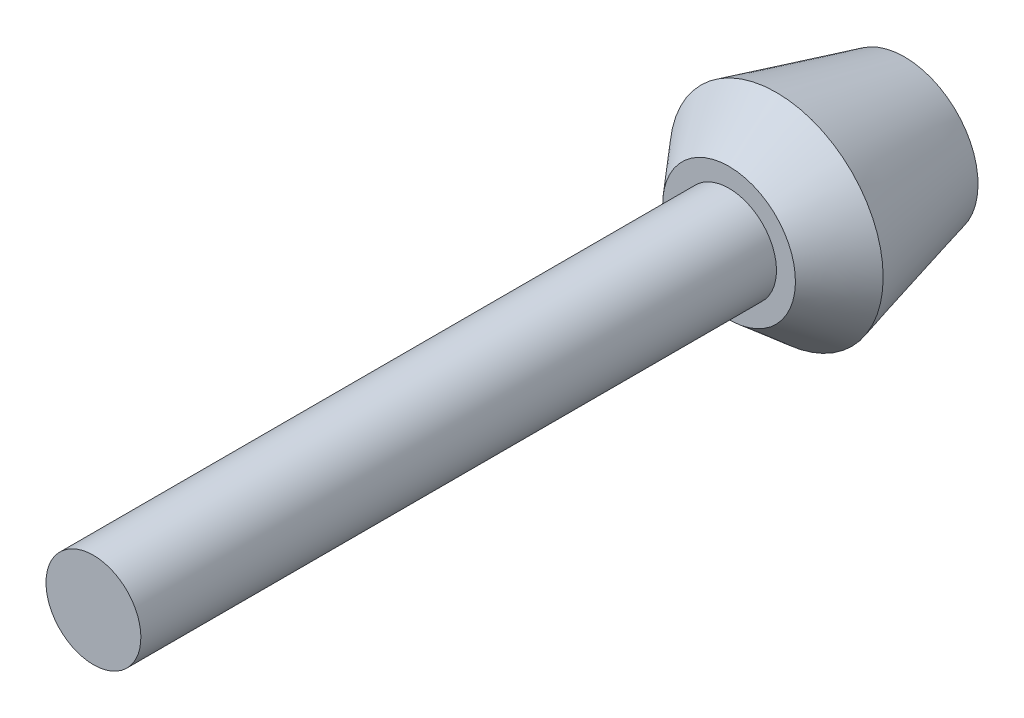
ISO-10303-21;
HEADER;
FILE_DESCRIPTION(('STEP AP214'),'2;1');
FILE_NAME('part.step','',(''),(''),'','','');
FILE_SCHEMA(('AUTOMOTIVE_DESIGN { 1 0 10303 214 1 1 1 1 }'));
ENDSEC;
DATA;
#1=APPLICATION_CONTEXT('core data for automotive mechanical design processes');
#2=APPLICATION_PROTOCOL_DEFINITION('international standard','automotive_design',2000,#1);
#3=PRODUCT_CONTEXT('',#1,'mechanical');
#4=PRODUCT('Part','Part','',(#3));
#5=PRODUCT_RELATED_PRODUCT_CATEGORY('part','',(#4));
#6=PRODUCT_DEFINITION_FORMATION('','',#4);
#7=PRODUCT_DEFINITION_CONTEXT('part definition',#1,'design');
#8=PRODUCT_DEFINITION('design','',#6,#7);
#9=PRODUCT_DEFINITION_SHAPE('','',#8);
#10=(LENGTH_UNIT() NAMED_UNIT(*) SI_UNIT(.MILLI.,.METRE.));
#11=(NAMED_UNIT(*) PLANE_ANGLE_UNIT() SI_UNIT($,.RADIAN.));
#12=(NAMED_UNIT(*) SI_UNIT($,.STERADIAN.) SOLID_ANGLE_UNIT());
#13=UNCERTAINTY_MEASURE_WITH_UNIT(LENGTH_MEASURE(1.E-05),#10,'distance_accuracy_value','');
#14=(GEOMETRIC_REPRESENTATION_CONTEXT(3) GLOBAL_UNCERTAINTY_ASSIGNED_CONTEXT((#13)) GLOBAL_UNIT_ASSIGNED_CONTEXT((#10,
#11,#12)) REPRESENTATION_CONTEXT('',''));
#15=CARTESIAN_POINT('',(0.,0.,0.));
#16=DIRECTION('',(0.,0.,1.));
#17=DIRECTION('',(1.,0.,0.));
#18=AXIS2_PLACEMENT_3D('',#15,#16,#17);
#19=CARTESIAN_POINT('',(0.,0.,0.));
#20=DIRECTION('',(0.,0.,-1.));
#21=DIRECTION('',(-0.769107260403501,0.639119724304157,0.));
#22=AXIS2_PLACEMENT_3D('',#19,#20,#21);
#23=PLANE('',#22);
#24=CARTESIAN_POINT('',(0.,0.,0.));
#25=DIRECTION('',(0.,0.,-1.));
#26=DIRECTION('',(0.,1.,0.));
#27=AXIS2_PLACEMENT_3D('',#24,#25,#26);
#28=CIRCLE('',#27,7.75);
#29=CARTESIAN_POINT('',(0.,7.75000000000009,0.));
#30=VERTEX_POINT('',#29);
#31=EDGE_CURVE('E33',#30,#30,#28,.F.);
#32=ORIENTED_EDGE('',*,*,#31,.F.);
#33=EDGE_LOOP('',(#32));
#34=FACE_BOUND('',#33,.T.);
#35=ADVANCED_FACE('F15',(#34),#23,.T.);
#36=CARTESIAN_POINT('',(0.,0.,13.2485883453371));
#37=DIRECTION('',(0.,0.,1.));
#38=DIRECTION('',(0.769107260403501,-0.639119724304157,0.));
#39=AXIS2_PLACEMENT_3D('',#36,#37,#38);
#40=CONICAL_SURFACE('',#39,11.1848192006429,0.253674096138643);
#41=ORIENTED_EDGE('',*,*,#31,.T.);
#42=EDGE_LOOP('',(#41));
#43=FACE_BOUND('',#42,.T.);
#44=CARTESIAN_POINT('',(0.,0.,13.5));
#45=DIRECTION('',(0.,0.,-1.));
#46=DIRECTION('',(0.,1.,0.));
#47=AXIS2_PLACEMENT_3D('',#44,#45,#46);
#48=CIRCLE('',#47,11.25);
#49=CARTESIAN_POINT('',(0.,11.2500000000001,13.5));
#50=VERTEX_POINT('',#49);
#51=EDGE_CURVE('E22',#50,#50,#48,.T.);
#52=ORIENTED_EDGE('',*,*,#51,.T.);
#53=EDGE_LOOP('',(#52));
#54=FACE_BOUND('',#53,.T.);
#55=ADVANCED_FACE('F54',(#43,#54),#40,.T.);
#56=CARTESIAN_POINT('',(0.,0.,13.6978936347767));
#57=DIRECTION('',(0.,0.,-1.));
#58=DIRECTION('',(-0.639119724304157,-0.769107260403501,0.));
#59=AXIS2_PLACEMENT_3D('',#56,#57,#58);
#60=CONICAL_SURFACE('',#59,11.0817904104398,0.704494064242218);
#61=CARTESIAN_POINT('',(0.,0.,18.5));
#62=DIRECTION('',(0.,0.,-1.));
#63=DIRECTION('',(0.,1.,0.));
#64=AXIS2_PLACEMENT_3D('',#61,#62,#63);
#65=CIRCLE('',#64,7.);
#66=CARTESIAN_POINT('',(0.,7.00000000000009,18.5));
#67=VERTEX_POINT('',#66);
#68=EDGE_CURVE('E10',#67,#67,#65,.F.);
#69=ORIENTED_EDGE('',*,*,#68,.F.);
#70=EDGE_LOOP('',(#69));
#71=FACE_BOUND('',#70,.T.);
#72=ORIENTED_EDGE('',*,*,#51,.F.);
#73=EDGE_LOOP('',(#72));
#74=FACE_BOUND('',#73,.T.);
#75=ADVANCED_FACE('F17',(#71,#74),#60,.T.);
#76=CARTESIAN_POINT('',(0.,0.,85.5));
#77=DIRECTION('',(0.,0.,-1.));
#78=DIRECTION('',(-0.692363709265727,0.721548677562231,0.));
#79=AXIS2_PLACEMENT_3D('',#76,#77,#78);
#80=PLANE('',#79);
#81=CARTESIAN_POINT('',(0.,0.,85.5));
#82=DIRECTION('',(0.,0.,-1.));
#83=DIRECTION('',(0.,1.,0.));
#84=AXIS2_PLACEMENT_3D('',#81,#82,#83);
#85=CIRCLE('',#84,5.);
#86=CARTESIAN_POINT('',(0.,4.99999999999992,85.5));
#87=VERTEX_POINT('',#86);
#88=EDGE_CURVE('E26',#87,#87,#85,.T.);
#89=ORIENTED_EDGE('',*,*,#88,.F.);
#90=EDGE_LOOP('',(#89));
#91=FACE_BOUND('',#90,.T.);
#92=ADVANCED_FACE('F50',(#91),#80,.F.);
#93=CARTESIAN_POINT('',(0.,0.,4.5));
#94=DIRECTION('',(0.,0.,1.));
#95=DIRECTION('',(0.692363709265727,-0.721548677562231,0.));
#96=AXIS2_PLACEMENT_3D('',#93,#94,#95);
#97=CYLINDRICAL_SURFACE('',#96,5.);
#98=CARTESIAN_POINT('',(0.,0.,18.5));
#99=DIRECTION('',(0.,0.,1.));
#100=DIRECTION('',(0.769107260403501,-0.639119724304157,0.));
#101=AXIS2_PLACEMENT_3D('',#98,#99,#100);
#102=CIRCLE('',#101,5.);
#103=CARTESIAN_POINT('',(3.8455363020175,-3.19559862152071,18.5));
#104=VERTEX_POINT('',#103);
#105=EDGE_CURVE('E30',#104,#104,#102,.T.);
#106=ORIENTED_EDGE('',*,*,#105,.T.);
#107=EDGE_LOOP('',(#106));
#108=FACE_BOUND('',#107,.T.);
#109=ORIENTED_EDGE('',*,*,#88,.T.);
#110=EDGE_LOOP('',(#109));
#111=FACE_BOUND('',#110,.T.);
#112=ADVANCED_FACE('F39',(#108,#111),#97,.T.);
#113=CARTESIAN_POINT('',(0.,0.,18.5));
#114=DIRECTION('',(0.,0.,-1.));
#115=DIRECTION('',(-0.769107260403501,0.639119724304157,0.));
#116=AXIS2_PLACEMENT_3D('',#113,#114,#115);
#117=PLANE('',#116);
#118=ORIENTED_EDGE('',*,*,#105,.F.);
#119=EDGE_LOOP('',(#118));
#120=FACE_BOUND('',#119,.T.);
#121=ORIENTED_EDGE('',*,*,#68,.T.);
#122=EDGE_LOOP('',(#121));
#123=FACE_BOUND('',#122,.T.);
#124=ADVANCED_FACE('F42',(#120,#123),#117,.F.);
#125=CLOSED_SHELL('',(#35,#55,#75,#92,#112,#124));
#126=MANIFOLD_SOLID_BREP('B1',#125);
#127=ADVANCED_BREP_SHAPE_REPRESENTATION('',(#18,#126),#14);
#128=SHAPE_DEFINITION_REPRESENTATION(#9,#127);
ENDSEC;
END-ISO-10303-21;
